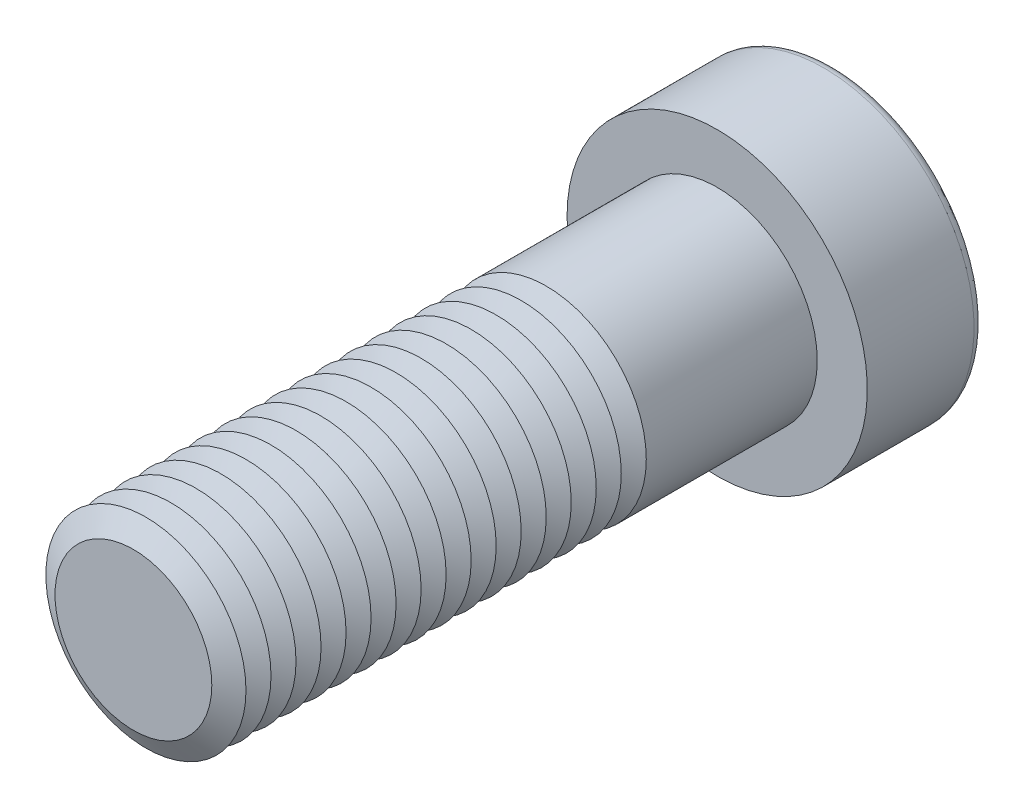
from build123d import *

# Parameters (mm, degrees)
SKETCH1_R           = 12
BOSS_EXTRUDE1_DEPTH = 70
SKETCH2_R           = 18
BOSS_EXTRUDE2_DEPTH = 14
CUT_EXTRUDE1_DEPTH  = 14.25
FILLET1_R           = 1.2
LPATTERN1_COUNT     = 17
LPATTERN1_PITCH     = 3


with BuildPart() as part:
    # Sketch1 → Boss-Extrude1 (new body)
    with BuildSketch(Plane.XY):
        Circle(SKETCH1_R)
    extrude(amount=BOSS_EXTRUDE1_DEPTH)

    # Sketch2 → Boss-Extrude2 (add)
    with BuildSketch(Plane(origin=(0, 0, 0), x_dir=(-1, 0, 0), z_dir=(0, 0, -1))):
        Circle(SKETCH2_R)
    extrude(amount=BOSS_EXTRUDE2_DEPTH)

    # Sketch3 → Cut-Extrude1 (cut)
    with BuildSketch(Plane(origin=(0, 0, -14), x_dir=(-1, 0, 0), z_dir=(0, 0, -1))):
        Polygon((-5.484827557, 9.5), (-10.969655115, 0), (-5.484827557, -9.5), (5.484827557, -9.5), (10.969655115, 0), (5.484827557, 9.5), align=None)
    extrude(amount=-CUT_EXTRUDE1_DEPTH, mode=Mode.SUBTRACT)

    # Fillet1
    fillet1_edges = [part.edges().sort_by_distance(p)[0] for p in [
        (18, 0, -14),
    ]]
    fillet(fillet1_edges, radius=FILLET1_R)

    # Cut-Extrude2 cone 1 section (on through the dimple's axis) → Cut-Extrude2 (revolve, cut)
    with BuildSketch(Plane(origin=(0, 0, 0.25), x_dir=(0, 1, 0), z_dir=(1, 0, 0))):
        Polygon((0, 0), (9.5, 0), (0, 5.484827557), align=None)
    revolve(axis=Axis((0, 0, 0.25), (0, 0, 1)), mode=Mode.SUBTRACT)

    # Cut-Extrude3 cone 1 section (on through the dimple's axis) → Cut-Extrude3 (revolve, cut)
    with BuildSketch(Plane(origin=(0, 0, -14), x_dir=(0, 1, 0), z_dir=(1, 0, 0))):
        Polygon((0, 0), (10.969655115, 0), (0, 2.939310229), align=None)
    revolve(axis=Axis((0, 0, -14), (0, 0, 1)), mode=Mode.SUBTRACT)

    # Sketch7 → Cut-Revolve1 (revolve, cut)
    with BuildSketch(Plane(origin=(0, 0, 0), x_dir=(0, 0, -1), z_dir=(1, 0, 0)), mode=Mode.PRIVATE) as cut_revolve1_sk:
        Polygon((-70, 9.401923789), (-68.5, 12), (-71.5, 12), align=None)
    cut_revolve1 = revolve(cut_revolve1_sk.sketch.rotate(Axis((0, 0, 70), (0, 0, -1)), 90), axis=Axis((0, 0, 70), (0, 0, -1)), mode=Mode.SUBTRACT)

    # LPattern1: Cut-Revolve1 ×17
    with Locations(*[(0, 0, -i * LPATTERN1_PITCH) for i in range(1, LPATTERN1_COUNT)]):
        add(cut_revolve1, mode=Mode.SUBTRACT)


solid = part.part
